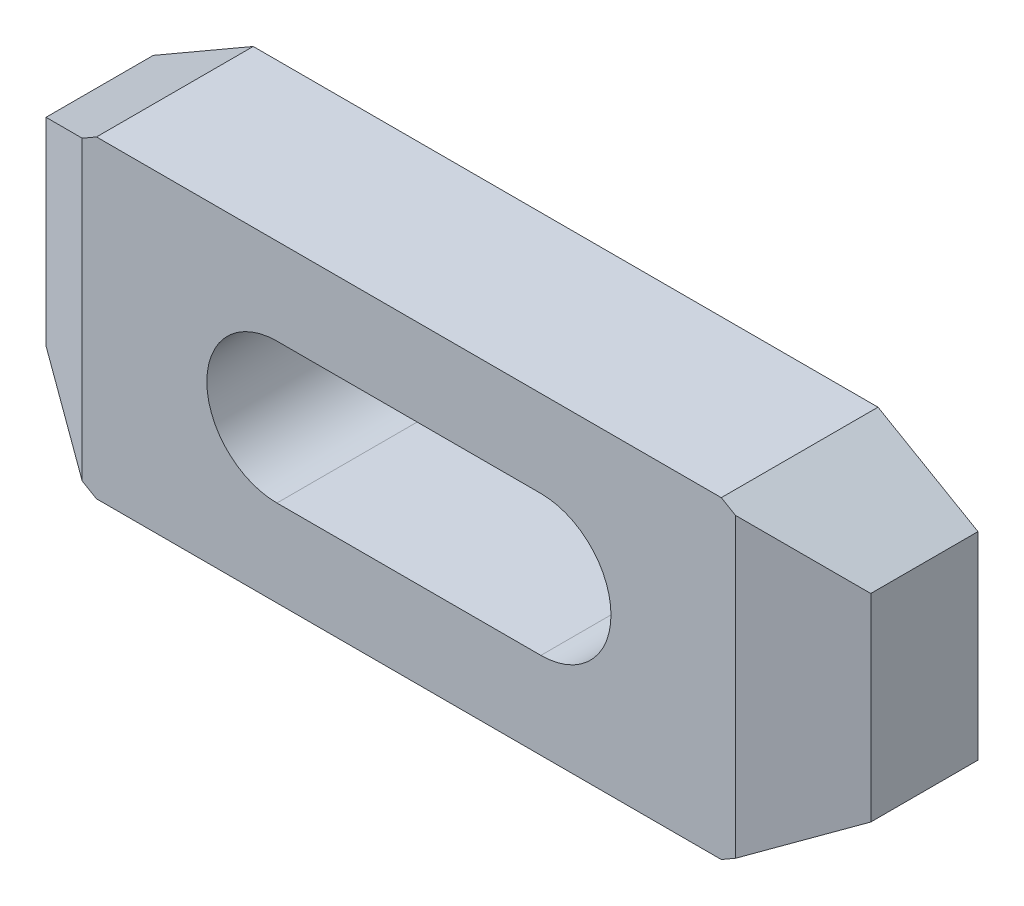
ISO-10303-21;
HEADER;
FILE_DESCRIPTION(('STEP AP214'),'2;1');
FILE_NAME('part.step','',(''),(''),'','','');
FILE_SCHEMA(('AUTOMOTIVE_DESIGN { 1 0 10303 214 1 1 1 1 }'));
ENDSEC;
DATA;
#1=APPLICATION_CONTEXT('core data for automotive mechanical design processes');
#2=APPLICATION_PROTOCOL_DEFINITION('international standard','automotive_design',2000,#1);
#3=PRODUCT_CONTEXT('',#1,'mechanical');
#4=PRODUCT('Part','Part','',(#3));
#5=PRODUCT_RELATED_PRODUCT_CATEGORY('part','',(#4));
#6=PRODUCT_DEFINITION_FORMATION('','',#4);
#7=PRODUCT_DEFINITION_CONTEXT('part definition',#1,'design');
#8=PRODUCT_DEFINITION('design','',#6,#7);
#9=PRODUCT_DEFINITION_SHAPE('','',#8);
#10=(LENGTH_UNIT() NAMED_UNIT(*) SI_UNIT(.MILLI.,.METRE.));
#11=(NAMED_UNIT(*) PLANE_ANGLE_UNIT() SI_UNIT($,.RADIAN.));
#12=(NAMED_UNIT(*) SI_UNIT($,.STERADIAN.) SOLID_ANGLE_UNIT());
#13=UNCERTAINTY_MEASURE_WITH_UNIT(LENGTH_MEASURE(1.E-05),#10,'distance_accuracy_value','');
#14=(GEOMETRIC_REPRESENTATION_CONTEXT(3) GLOBAL_UNCERTAINTY_ASSIGNED_CONTEXT((#13)) GLOBAL_UNIT_ASSIGNED_CONTEXT((#10,
#11,#12)) REPRESENTATION_CONTEXT('',''));
#15=CARTESIAN_POINT('',(0.,0.,0.));
#16=DIRECTION('',(0.,0.,1.));
#17=DIRECTION('',(1.,0.,0.));
#18=AXIS2_PLACEMENT_3D('',#15,#16,#17);
#19=CARTESIAN_POINT('',(0.,-40.8675134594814,19.));
#20=DIRECTION('',(0.,0.,-1.));
#21=DIRECTION('',(-1.,0.,0.));
#22=AXIS2_PLACEMENT_3D('',#19,#20,#21);
#23=PLANE('',#22);
#24=CARTESIAN_POINT('',(16.,0.,19.));
#25=DIRECTION('',(0.,0.,1.));
#26=DIRECTION('',(1.,0.,0.));
#27=AXIS2_PLACEMENT_3D('',#24,#25,#26);
#28=CIRCLE('',#27,8.5);
#29=CARTESIAN_POINT('',(16.,-8.5,19.));
#30=VERTEX_POINT('',#29);
#31=CARTESIAN_POINT('',(16.,8.5,19.));
#32=VERTEX_POINT('',#31);
#33=EDGE_CURVE('E221',#30,#32,#28,.T.);
#34=ORIENTED_EDGE('',*,*,#33,.F.);
#35=DIRECTION('',(-1.,0.,0.));
#36=VECTOR('',#35,1.);
#37=CARTESIAN_POINT('',(16.,-8.5,19.));
#38=LINE('',#37,#36);
#39=CARTESIAN_POINT('',(-16.,-8.5,19.));
#40=VERTEX_POINT('',#39);
#41=EDGE_CURVE('E220',#30,#40,#38,.T.);
#42=ORIENTED_EDGE('',*,*,#41,.T.);
#43=CARTESIAN_POINT('',(-16.,0.,19.));
#44=DIRECTION('',(0.,0.,1.));
#45=DIRECTION('',(1.,0.,0.));
#46=AXIS2_PLACEMENT_3D('',#43,#44,#45);
#47=CIRCLE('',#46,8.5);
#48=CARTESIAN_POINT('',(-16.,8.5,19.));
#49=VERTEX_POINT('',#48);
#50=EDGE_CURVE('E228',#49,#40,#47,.T.);
#51=ORIENTED_EDGE('',*,*,#50,.F.);
#52=DIRECTION('',(-1.,0.,0.));
#53=VECTOR('',#52,1.);
#54=CARTESIAN_POINT('',(16.,8.5,19.));
#55=LINE('',#54,#53);
#56=EDGE_CURVE('E224',#32,#49,#55,.T.);
#57=ORIENTED_EDGE('',*,*,#56,.F.);
#58=EDGE_LOOP('',(#34,#42,#51,#57));
#59=FACE_BOUND('',#58,.T.);
#60=DIRECTION('',(0.,1.,0.));
#61=VECTOR('',#60,1.);
#62=CARTESIAN_POINT('',(-39.6076951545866,-40.8675134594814,19.));
#63=LINE('',#62,#61);
#64=CARTESIAN_POINT('',(-39.6076951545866,-18.,19.));
#65=VERTEX_POINT('',#64);
#66=CARTESIAN_POINT('',(-39.6076951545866,18.,19.));
#67=VERTEX_POINT('',#66);
#68=EDGE_CURVE('E115',#65,#67,#63,.T.);
#69=ORIENTED_EDGE('',*,*,#68,.F.);
#70=DIRECTION('',(-0.866025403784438,0.5,0.));
#71=VECTOR('',#70,1.);
#72=CARTESIAN_POINT('',(-37.8756443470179,-19.,19.));
#73=LINE('',#72,#71);
#74=CARTESIAN_POINT('',(-37.8756443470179,-19.,19.));
#75=VERTEX_POINT('',#74);
#76=EDGE_CURVE('E174',#75,#65,#73,.T.);
#77=ORIENTED_EDGE('',*,*,#76,.F.);
#78=DIRECTION('',(-1.,0.,0.));
#79=VECTOR('',#78,1.);
#80=CARTESIAN_POINT('',(37.8756443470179,-19.,19.));
#81=LINE('',#80,#79);
#82=CARTESIAN_POINT('',(37.8756443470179,-19.,19.));
#83=VERTEX_POINT('',#82);
#84=EDGE_CURVE('E177',#83,#75,#81,.T.);
#85=ORIENTED_EDGE('',*,*,#84,.F.);
#86=DIRECTION('',(-0.866025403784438,-0.5,0.));
#87=VECTOR('',#86,1.);
#88=CARTESIAN_POINT('',(50.,-12.,19.));
#89=LINE('',#88,#87);
#90=CARTESIAN_POINT('',(39.6076951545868,-18.,19.));
#91=VERTEX_POINT('',#90);
#92=EDGE_CURVE('E157',#91,#83,#89,.T.);
#93=ORIENTED_EDGE('',*,*,#92,.F.);
#94=DIRECTION('',(0.,1.,0.));
#95=VECTOR('',#94,1.);
#96=CARTESIAN_POINT('',(39.6076951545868,-40.8675134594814,19.));
#97=LINE('',#96,#95);
#98=CARTESIAN_POINT('',(39.6076951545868,18.,19.));
#99=VERTEX_POINT('',#98);
#100=EDGE_CURVE('E146',#91,#99,#97,.T.);
#101=ORIENTED_EDGE('',*,*,#100,.T.);
#102=DIRECTION('',(0.866025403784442,-0.499999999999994,0.));
#103=VECTOR('',#102,1.);
#104=CARTESIAN_POINT('',(37.8756443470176,19.,19.));
#105=LINE('',#104,#103);
#106=CARTESIAN_POINT('',(37.8756443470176,19.,19.));
#107=VERTEX_POINT('',#106);
#108=EDGE_CURVE('E155',#107,#99,#105,.T.);
#109=ORIENTED_EDGE('',*,*,#108,.F.);
#110=DIRECTION('',(1.,0.,0.));
#111=VECTOR('',#110,1.);
#112=CARTESIAN_POINT('',(-37.8756443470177,19.,19.));
#113=LINE('',#112,#111);
#114=CARTESIAN_POINT('',(-37.8756443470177,19.,19.));
#115=VERTEX_POINT('',#114);
#116=EDGE_CURVE('E164',#115,#107,#113,.T.);
#117=ORIENTED_EDGE('',*,*,#116,.F.);
#118=DIRECTION('',(0.866025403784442,0.5,0.));
#119=VECTOR('',#118,1.);
#120=CARTESIAN_POINT('',(-50.,12.,19.));
#121=LINE('',#120,#119);
#122=EDGE_CURVE('E167',#67,#115,#121,.T.);
#123=ORIENTED_EDGE('',*,*,#122,.F.);
#124=EDGE_LOOP('',(#69,#77,#85,#93,#101,#109,#117,#123));
#125=FACE_BOUND('',#124,.T.);
#126=ADVANCED_FACE('F14',(#59,#125),#23,.F.);
#127=CARTESIAN_POINT('',(-50.,12.,19.));
#128=DIRECTION('',(-0.5,0.866025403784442,0.));
#129=DIRECTION('',(-0.866025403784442,-0.5,0.));
#130=AXIS2_PLACEMENT_3D('',#127,#128,#129);
#131=PLANE('',#130);
#132=DIRECTION('',(0.,0.,-1.));
#133=VECTOR('',#132,1.);
#134=CARTESIAN_POINT('',(-50.,12.,19.));
#135=LINE('',#134,#133);
#136=CARTESIAN_POINT('',(-50.,12.,13.));
#137=VERTEX_POINT('',#136);
#138=CARTESIAN_POINT('',(-50.,12.,0.));
#139=VERTEX_POINT('',#138);
#140=EDGE_CURVE('E124',#137,#139,#135,.T.);
#141=ORIENTED_EDGE('',*,*,#140,.F.);
#142=DIRECTION('',(0.774596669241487,0.447213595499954,0.447213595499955));
#143=VECTOR('',#142,1.);
#144=CARTESIAN_POINT('',(-47.9215390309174,13.2,14.2));
#145=LINE('',#144,#143);
#146=EDGE_CURVE('E112',#137,#67,#145,.T.);
#147=ORIENTED_EDGE('',*,*,#146,.T.);
#148=ORIENTED_EDGE('',*,*,#122,.T.);
#149=DIRECTION('',(0.,0.,-1.));
#150=VECTOR('',#149,1.);
#151=CARTESIAN_POINT('',(-37.8756443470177,19.,19.));
#152=LINE('',#151,#150);
#153=CARTESIAN_POINT('',(-37.8756443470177,19.,0.));
#154=VERTEX_POINT('',#153);
#155=EDGE_CURVE('E132',#115,#154,#152,.T.);
#156=ORIENTED_EDGE('',*,*,#155,.T.);
#157=DIRECTION('',(0.866025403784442,0.5,0.));
#158=VECTOR('',#157,1.);
#159=CARTESIAN_POINT('',(-50.,12.,0.));
#160=LINE('',#159,#158);
#161=EDGE_CURVE('E131',#139,#154,#160,.T.);
#162=ORIENTED_EDGE('',*,*,#161,.F.);
#163=EDGE_LOOP('',(#141,#147,#148,#156,#162));
#164=FACE_BOUND('',#163,.T.);
#165=ADVANCED_FACE('F129',(#164),#131,.T.);
#166=CARTESIAN_POINT('',(-50.,-12.,19.));
#167=DIRECTION('',(-1.,0.,0.));
#168=DIRECTION('',(0.,0.,1.));
#169=AXIS2_PLACEMENT_3D('',#166,#167,#168);
#170=PLANE('',#169);
#171=DIRECTION('',(0.,0.,-1.));
#172=VECTOR('',#171,1.);
#173=CARTESIAN_POINT('',(-50.,-12.,19.));
#174=LINE('',#173,#172);
#175=CARTESIAN_POINT('',(-50.,-12.,13.));
#176=VERTEX_POINT('',#175);
#177=CARTESIAN_POINT('',(-50.,-12.,0.));
#178=VERTEX_POINT('',#177);
#179=EDGE_CURVE('E126',#176,#178,#174,.T.);
#180=ORIENTED_EDGE('',*,*,#179,.F.);
#181=DIRECTION('',(0.,1.,0.));
#182=VECTOR('',#181,1.);
#183=CARTESIAN_POINT('',(-50.,-20.,13.));
#184=LINE('',#183,#182);
#185=EDGE_CURVE('E29',#176,#137,#184,.T.);
#186=ORIENTED_EDGE('',*,*,#185,.T.);
#187=ORIENTED_EDGE('',*,*,#140,.T.);
#188=DIRECTION('',(0.,1.,0.));
#189=VECTOR('',#188,1.);
#190=CARTESIAN_POINT('',(-50.,-12.,0.));
#191=LINE('',#190,#189);
#192=EDGE_CURVE('E199',#178,#139,#191,.T.);
#193=ORIENTED_EDGE('',*,*,#192,.F.);
#194=EDGE_LOOP('',(#180,#186,#187,#193));
#195=FACE_BOUND('',#194,.T.);
#196=ADVANCED_FACE('F122',(#195),#170,.T.);
#197=CARTESIAN_POINT('',(-37.8756443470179,-19.,19.));
#198=DIRECTION('',(-0.5,-0.866025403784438,0.));
#199=DIRECTION('',(0.866025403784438,-0.5,0.));
#200=AXIS2_PLACEMENT_3D('',#197,#198,#199);
#201=PLANE('',#200);
#202=ORIENTED_EDGE('',*,*,#76,.T.);
#203=DIRECTION('',(-0.774596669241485,0.44721359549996,-0.447213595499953));
#204=VECTOR('',#203,1.);
#205=CARTESIAN_POINT('',(-38.2220545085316,-18.8,19.8));
#206=LINE('',#205,#204);
#207=EDGE_CURVE('E9',#65,#176,#206,.T.);
#208=ORIENTED_EDGE('',*,*,#207,.T.);
#209=ORIENTED_EDGE('',*,*,#179,.T.);
#210=DIRECTION('',(-0.866025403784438,0.5,0.));
#211=VECTOR('',#210,1.);
#212=CARTESIAN_POINT('',(-37.8756443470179,-19.,0.));
#213=LINE('',#212,#211);
#214=CARTESIAN_POINT('',(-37.8756443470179,-19.,0.));
#215=VERTEX_POINT('',#214);
#216=EDGE_CURVE('E195',#215,#178,#213,.T.);
#217=ORIENTED_EDGE('',*,*,#216,.F.);
#218=DIRECTION('',(0.,0.,-1.));
#219=VECTOR('',#218,1.);
#220=CARTESIAN_POINT('',(-37.8756443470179,-19.,19.));
#221=LINE('',#220,#219);
#222=EDGE_CURVE('E136',#75,#215,#221,.T.);
#223=ORIENTED_EDGE('',*,*,#222,.F.);
#224=EDGE_LOOP('',(#202,#208,#209,#217,#223));
#225=FACE_BOUND('',#224,.T.);
#226=ADVANCED_FACE('F198',(#225),#201,.T.);
#227=CARTESIAN_POINT('',(0.,-40.8675134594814,0.));
#228=DIRECTION('',(0.,0.,-1.));
#229=DIRECTION('',(-1.,0.,0.));
#230=AXIS2_PLACEMENT_3D('',#227,#228,#229);
#231=PLANE('',#230);
#232=DIRECTION('',(-0.866025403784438,-0.5,0.));
#233=VECTOR('',#232,1.);
#234=CARTESIAN_POINT('',(50.,-12.,0.));
#235=LINE('',#234,#233);
#236=CARTESIAN_POINT('',(50.,-12.,0.));
#237=VERTEX_POINT('',#236);
#238=CARTESIAN_POINT('',(37.8756443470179,-19.,0.));
#239=VERTEX_POINT('',#238);
#240=EDGE_CURVE('E170',#237,#239,#235,.T.);
#241=ORIENTED_EDGE('',*,*,#240,.T.);
#242=DIRECTION('',(-1.,0.,0.));
#243=VECTOR('',#242,1.);
#244=CARTESIAN_POINT('',(37.8756443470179,-19.,0.));
#245=LINE('',#244,#243);
#246=EDGE_CURVE('E186',#239,#215,#245,.T.);
#247=ORIENTED_EDGE('',*,*,#246,.T.);
#248=ORIENTED_EDGE('',*,*,#216,.T.);
#249=ORIENTED_EDGE('',*,*,#192,.T.);
#250=ORIENTED_EDGE('',*,*,#161,.T.);
#251=DIRECTION('',(1.,0.,0.));
#252=VECTOR('',#251,1.);
#253=CARTESIAN_POINT('',(-37.8756443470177,19.,0.));
#254=LINE('',#253,#252);
#255=CARTESIAN_POINT('',(37.8756443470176,19.,0.));
#256=VERTEX_POINT('',#255);
#257=EDGE_CURVE('E204',#154,#256,#254,.T.);
#258=ORIENTED_EDGE('',*,*,#257,.T.);
#259=DIRECTION('',(0.866025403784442,-0.499999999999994,0.));
#260=VECTOR('',#259,1.);
#261=CARTESIAN_POINT('',(37.8756443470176,19.,0.));
#262=LINE('',#261,#260);
#263=CARTESIAN_POINT('',(50.,12.,0.));
#264=VERTEX_POINT('',#263);
#265=EDGE_CURVE('E207',#256,#264,#262,.T.);
#266=ORIENTED_EDGE('',*,*,#265,.T.);
#267=DIRECTION('',(0.,-1.,0.));
#268=VECTOR('',#267,1.);
#269=CARTESIAN_POINT('',(50.,12.,0.));
#270=LINE('',#269,#268);
#271=EDGE_CURVE('E180',#264,#237,#270,.T.);
#272=ORIENTED_EDGE('',*,*,#271,.T.);
#273=EDGE_LOOP('',(#241,#247,#248,#249,#250,#258,#266,#272));
#274=FACE_BOUND('',#273,.T.);
#275=DIRECTION('',(-1.,0.,0.));
#276=VECTOR('',#275,1.);
#277=CARTESIAN_POINT('',(16.,-8.5,0.));
#278=LINE('',#277,#276);
#279=CARTESIAN_POINT('',(16.,-8.5,0.));
#280=VERTEX_POINT('',#279);
#281=CARTESIAN_POINT('',(-16.,-8.5,0.));
#282=VERTEX_POINT('',#281);
#283=EDGE_CURVE('E225',#280,#282,#278,.T.);
#284=ORIENTED_EDGE('',*,*,#283,.F.);
#285=CARTESIAN_POINT('',(16.,0.,0.));
#286=DIRECTION('',(0.,0.,1.));
#287=DIRECTION('',(1.,0.,0.));
#288=AXIS2_PLACEMENT_3D('',#285,#286,#287);
#289=CIRCLE('',#288,8.5);
#290=CARTESIAN_POINT('',(16.,8.5,0.));
#291=VERTEX_POINT('',#290);
#292=EDGE_CURVE('E232',#280,#291,#289,.T.);
#293=ORIENTED_EDGE('',*,*,#292,.T.);
#294=DIRECTION('',(-1.,0.,0.));
#295=VECTOR('',#294,1.);
#296=CARTESIAN_POINT('',(16.,8.5,0.));
#297=LINE('',#296,#295);
#298=CARTESIAN_POINT('',(-16.,8.5,0.));
#299=VERTEX_POINT('',#298);
#300=EDGE_CURVE('E235',#291,#299,#297,.T.);
#301=ORIENTED_EDGE('',*,*,#300,.T.);
#302=CARTESIAN_POINT('',(-16.,0.,0.));
#303=DIRECTION('',(0.,0.,1.));
#304=DIRECTION('',(1.,0.,0.));
#305=AXIS2_PLACEMENT_3D('',#302,#303,#304);
#306=CIRCLE('',#305,8.5);
#307=EDGE_CURVE('E238',#299,#282,#306,.T.);
#308=ORIENTED_EDGE('',*,*,#307,.T.);
#309=EDGE_LOOP('',(#284,#293,#301,#308));
#310=FACE_BOUND('',#309,.T.);
#311=ADVANCED_FACE('F193',(#274,#310),#231,.T.);
#312=CARTESIAN_POINT('',(50.,-12.,19.));
#313=DIRECTION('',(0.5,-0.866025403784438,0.));
#314=DIRECTION('',(0.866025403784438,0.5,0.));
#315=AXIS2_PLACEMENT_3D('',#312,#313,#314);
#316=PLANE('',#315);
#317=DIRECTION('',(0.774596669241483,0.447213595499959,-0.447213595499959));
#318=VECTOR('',#317,1.);
#319=CARTESIAN_POINT('',(47.9215390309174,-13.2,14.2));
#320=LINE('',#319,#318);
#321=CARTESIAN_POINT('',(50.,-12.,13.));
#322=VERTEX_POINT('',#321);
#323=EDGE_CURVE('E158',#91,#322,#320,.T.);
#324=ORIENTED_EDGE('',*,*,#323,.F.);
#325=ORIENTED_EDGE('',*,*,#92,.T.);
#326=DIRECTION('',(0.,0.,-1.));
#327=VECTOR('',#326,1.);
#328=CARTESIAN_POINT('',(37.8756443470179,-19.,19.));
#329=LINE('',#328,#327);
#330=EDGE_CURVE('E163',#83,#239,#329,.T.);
#331=ORIENTED_EDGE('',*,*,#330,.T.);
#332=ORIENTED_EDGE('',*,*,#240,.F.);
#333=DIRECTION('',(0.,0.,-1.));
#334=VECTOR('',#333,1.);
#335=CARTESIAN_POINT('',(50.,-12.,19.));
#336=LINE('',#335,#334);
#337=EDGE_CURVE('E143',#322,#237,#336,.T.);
#338=ORIENTED_EDGE('',*,*,#337,.F.);
#339=EDGE_LOOP('',(#324,#325,#331,#332,#338));
#340=FACE_BOUND('',#339,.T.);
#341=ADVANCED_FACE('F249',(#340),#316,.T.);
#342=CARTESIAN_POINT('',(50.,12.,19.));
#343=DIRECTION('',(1.,0.,0.));
#344=DIRECTION('',(0.,0.,-1.));
#345=AXIS2_PLACEMENT_3D('',#342,#343,#344);
#346=PLANE('',#345);
#347=DIRECTION('',(0.,1.,0.));
#348=VECTOR('',#347,1.);
#349=CARTESIAN_POINT('',(50.,-20.,13.));
#350=LINE('',#349,#348);
#351=CARTESIAN_POINT('',(50.,12.,13.));
#352=VERTEX_POINT('',#351);
#353=EDGE_CURVE('E36',#322,#352,#350,.T.);
#354=ORIENTED_EDGE('',*,*,#353,.F.);
#355=ORIENTED_EDGE('',*,*,#337,.T.);
#356=ORIENTED_EDGE('',*,*,#271,.F.);
#357=DIRECTION('',(0.,0.,-1.));
#358=VECTOR('',#357,1.);
#359=CARTESIAN_POINT('',(50.,12.,19.));
#360=LINE('',#359,#358);
#361=EDGE_CURVE('E141',#352,#264,#360,.T.);
#362=ORIENTED_EDGE('',*,*,#361,.F.);
#363=EDGE_LOOP('',(#354,#355,#356,#362));
#364=FACE_BOUND('',#363,.T.);
#365=ADVANCED_FACE('F16',(#364),#346,.T.);
#366=CARTESIAN_POINT('',(37.8756443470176,19.,19.));
#367=DIRECTION('',(0.499999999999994,0.866025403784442,0.));
#368=DIRECTION('',(-0.866025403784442,0.5,0.));
#369=AXIS2_PLACEMENT_3D('',#366,#367,#368);
#370=PLANE('',#369);
#371=DIRECTION('',(-0.774596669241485,0.447213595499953,0.44721359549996));
#372=VECTOR('',#371,1.);
#373=CARTESIAN_POINT('',(38.2220545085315,18.8,19.8));
#374=LINE('',#373,#372);
#375=EDGE_CURVE('E22',#352,#99,#374,.T.);
#376=ORIENTED_EDGE('',*,*,#375,.F.);
#377=ORIENTED_EDGE('',*,*,#361,.T.);
#378=ORIENTED_EDGE('',*,*,#265,.F.);
#379=DIRECTION('',(0.,0.,-1.));
#380=VECTOR('',#379,1.);
#381=CARTESIAN_POINT('',(37.8756443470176,19.,19.));
#382=LINE('',#381,#380);
#383=EDGE_CURVE('E134',#107,#256,#382,.T.);
#384=ORIENTED_EDGE('',*,*,#383,.F.);
#385=ORIENTED_EDGE('',*,*,#108,.T.);
#386=EDGE_LOOP('',(#376,#377,#378,#384,#385));
#387=FACE_BOUND('',#386,.T.);
#388=ADVANCED_FACE('F160',(#387),#370,.T.);
#389=CARTESIAN_POINT('',(-37.8756443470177,19.,19.));
#390=DIRECTION('',(0.,1.,0.));
#391=DIRECTION('',(-1.,0.,0.));
#392=AXIS2_PLACEMENT_3D('',#389,#390,#391);
#393=PLANE('',#392);
#394=ORIENTED_EDGE('',*,*,#155,.F.);
#395=ORIENTED_EDGE('',*,*,#116,.T.);
#396=ORIENTED_EDGE('',*,*,#383,.T.);
#397=ORIENTED_EDGE('',*,*,#257,.F.);
#398=EDGE_LOOP('',(#394,#395,#396,#397));
#399=FACE_BOUND('',#398,.T.);
#400=ADVANCED_FACE('F253',(#399),#393,.T.);
#401=CARTESIAN_POINT('',(37.8756443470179,-19.,19.));
#402=DIRECTION('',(0.,-1.,0.));
#403=DIRECTION('',(1.,0.,0.));
#404=AXIS2_PLACEMENT_3D('',#401,#402,#403);
#405=PLANE('',#404);
#406=ORIENTED_EDGE('',*,*,#84,.T.);
#407=ORIENTED_EDGE('',*,*,#222,.T.);
#408=ORIENTED_EDGE('',*,*,#246,.F.);
#409=ORIENTED_EDGE('',*,*,#330,.F.);
#410=EDGE_LOOP('',(#406,#407,#408,#409));
#411=FACE_BOUND('',#410,.T.);
#412=ADVANCED_FACE('F184',(#411),#405,.T.);
#413=CARTESIAN_POINT('',(16.,0.,19.));
#414=DIRECTION('',(0.,0.,-1.));
#415=DIRECTION('',(-1.,0.,0.));
#416=AXIS2_PLACEMENT_3D('',#413,#414,#415);
#417=CYLINDRICAL_SURFACE('',#416,8.5);
#418=DIRECTION('',(0.,0.,-1.));
#419=VECTOR('',#418,1.);
#420=CARTESIAN_POINT('',(16.,8.5,19.));
#421=LINE('',#420,#419);
#422=EDGE_CURVE('E211',#32,#291,#421,.T.);
#423=ORIENTED_EDGE('',*,*,#422,.T.);
#424=ORIENTED_EDGE('',*,*,#292,.F.);
#425=DIRECTION('',(0.,0.,-1.));
#426=VECTOR('',#425,1.);
#427=CARTESIAN_POINT('',(16.,-8.5,19.));
#428=LINE('',#427,#426);
#429=EDGE_CURVE('E217',#30,#280,#428,.T.);
#430=ORIENTED_EDGE('',*,*,#429,.F.);
#431=ORIENTED_EDGE('',*,*,#33,.T.);
#432=EDGE_LOOP('',(#423,#424,#430,#431));
#433=FACE_BOUND('',#432,.T.);
#434=ADVANCED_FACE('F261',(#433),#417,.F.);
#435=CARTESIAN_POINT('',(16.,8.5,19.));
#436=DIRECTION('',(0.,-1.,0.));
#437=DIRECTION('',(1.,0.,0.));
#438=AXIS2_PLACEMENT_3D('',#435,#436,#437);
#439=PLANE('',#438);
#440=DIRECTION('',(0.,0.,-1.));
#441=VECTOR('',#440,1.);
#442=CARTESIAN_POINT('',(-16.,8.5,19.));
#443=LINE('',#442,#441);
#444=EDGE_CURVE('E213',#49,#299,#443,.T.);
#445=ORIENTED_EDGE('',*,*,#444,.T.);
#446=ORIENTED_EDGE('',*,*,#300,.F.);
#447=ORIENTED_EDGE('',*,*,#422,.F.);
#448=ORIENTED_EDGE('',*,*,#56,.T.);
#449=EDGE_LOOP('',(#445,#446,#447,#448));
#450=FACE_BOUND('',#449,.T.);
#451=ADVANCED_FACE('F336',(#450),#439,.T.);
#452=CARTESIAN_POINT('',(-16.,0.,19.));
#453=DIRECTION('',(0.,0.,-1.));
#454=DIRECTION('',(-1.,0.,0.));
#455=AXIS2_PLACEMENT_3D('',#452,#453,#454);
#456=CYLINDRICAL_SURFACE('',#455,8.5);
#457=DIRECTION('',(0.,0.,-1.));
#458=VECTOR('',#457,1.);
#459=CARTESIAN_POINT('',(-16.,-8.5,19.));
#460=LINE('',#459,#458);
#461=EDGE_CURVE('E215',#40,#282,#460,.T.);
#462=ORIENTED_EDGE('',*,*,#461,.T.);
#463=ORIENTED_EDGE('',*,*,#307,.F.);
#464=ORIENTED_EDGE('',*,*,#444,.F.);
#465=ORIENTED_EDGE('',*,*,#50,.T.);
#466=EDGE_LOOP('',(#462,#463,#464,#465));
#467=FACE_BOUND('',#466,.T.);
#468=ADVANCED_FACE('F346',(#467),#456,.F.);
#469=CARTESIAN_POINT('',(16.,-8.5,19.));
#470=DIRECTION('',(0.,-1.,0.));
#471=DIRECTION('',(1.,0.,0.));
#472=AXIS2_PLACEMENT_3D('',#469,#470,#471);
#473=PLANE('',#472);
#474=ORIENTED_EDGE('',*,*,#41,.F.);
#475=ORIENTED_EDGE('',*,*,#429,.T.);
#476=ORIENTED_EDGE('',*,*,#283,.T.);
#477=ORIENTED_EDGE('',*,*,#461,.F.);
#478=EDGE_LOOP('',(#474,#475,#476,#477));
#479=FACE_BOUND('',#478,.T.);
#480=ADVANCED_FACE('F355',(#479),#473,.F.);
#481=CARTESIAN_POINT('',(50.,-20.,13.));
#482=DIRECTION('',(-0.5,0.,-0.866025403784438));
#483=DIRECTION('',(-0.866025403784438,0.,0.5));
#484=AXIS2_PLACEMENT_3D('',#481,#482,#483);
#485=PLANE('',#484);
#486=ORIENTED_EDGE('',*,*,#323,.T.);
#487=ORIENTED_EDGE('',*,*,#353,.T.);
#488=ORIENTED_EDGE('',*,*,#375,.T.);
#489=ORIENTED_EDGE('',*,*,#100,.F.);
#490=EDGE_LOOP('',(#486,#487,#488,#489));
#491=FACE_BOUND('',#490,.T.);
#492=ADVANCED_FACE('F145',(#491),#485,.F.);
#493=CARTESIAN_POINT('',(-50.,-20.,13.));
#494=DIRECTION('',(-0.5,0.,0.866025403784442));
#495=DIRECTION('',(0.866025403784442,0.,0.5));
#496=AXIS2_PLACEMENT_3D('',#493,#494,#495);
#497=PLANE('',#496);
#498=ORIENTED_EDGE('',*,*,#185,.F.);
#499=ORIENTED_EDGE('',*,*,#207,.F.);
#500=ORIENTED_EDGE('',*,*,#68,.T.);
#501=ORIENTED_EDGE('',*,*,#146,.F.);
#502=EDGE_LOOP('',(#498,#499,#500,#501));
#503=FACE_BOUND('',#502,.T.);
#504=ADVANCED_FACE('F113',(#503),#497,.T.);
#505=CLOSED_SHELL('',(#126,#165,#196,#226,#311,#341,#365,#388,#400,#412,#434,#451,#468,#480,
#492,#504));
#506=MANIFOLD_SOLID_BREP('B1',#505);
#507=ADVANCED_BREP_SHAPE_REPRESENTATION('',(#18,#506),#14);
#508=SHAPE_DEFINITION_REPRESENTATION(#9,#507);
ENDSEC;
END-ISO-10303-21;
